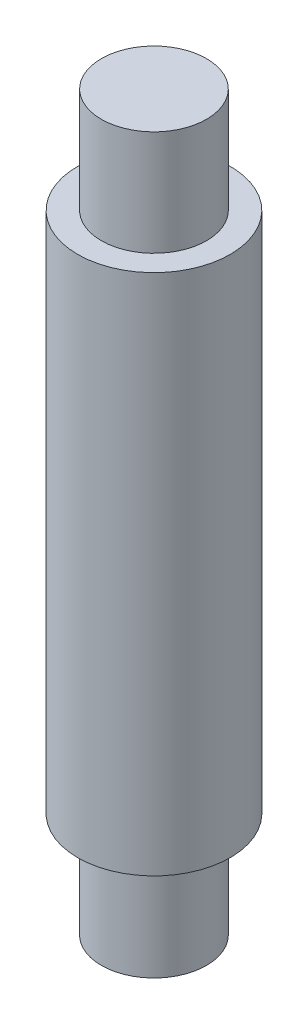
from build123d import *


with BuildPart() as part:
    # Sketch1 → Revolve1 (revolve)
    with BuildSketch(Plane.XY, mode=Mode.PRIVATE) as revolve1_sk:
        Polygon((0, 105.094055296), (15.084087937, 105.094055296), (15.084087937, 74.925879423), (21.880722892, 74.925879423), (21.880722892, -74.925879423), (15.084087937, -74.925879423), (15.084087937, -105.094055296), (0, -105.094055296), align=None)
    revolve(revolve1_sk.sketch.rotate(Axis((0, 112.021820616, 0), (0, -1, 0)), 90), axis=Axis((0, 112.021820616, 0), (0, -1, 0)))


solid = part.part
